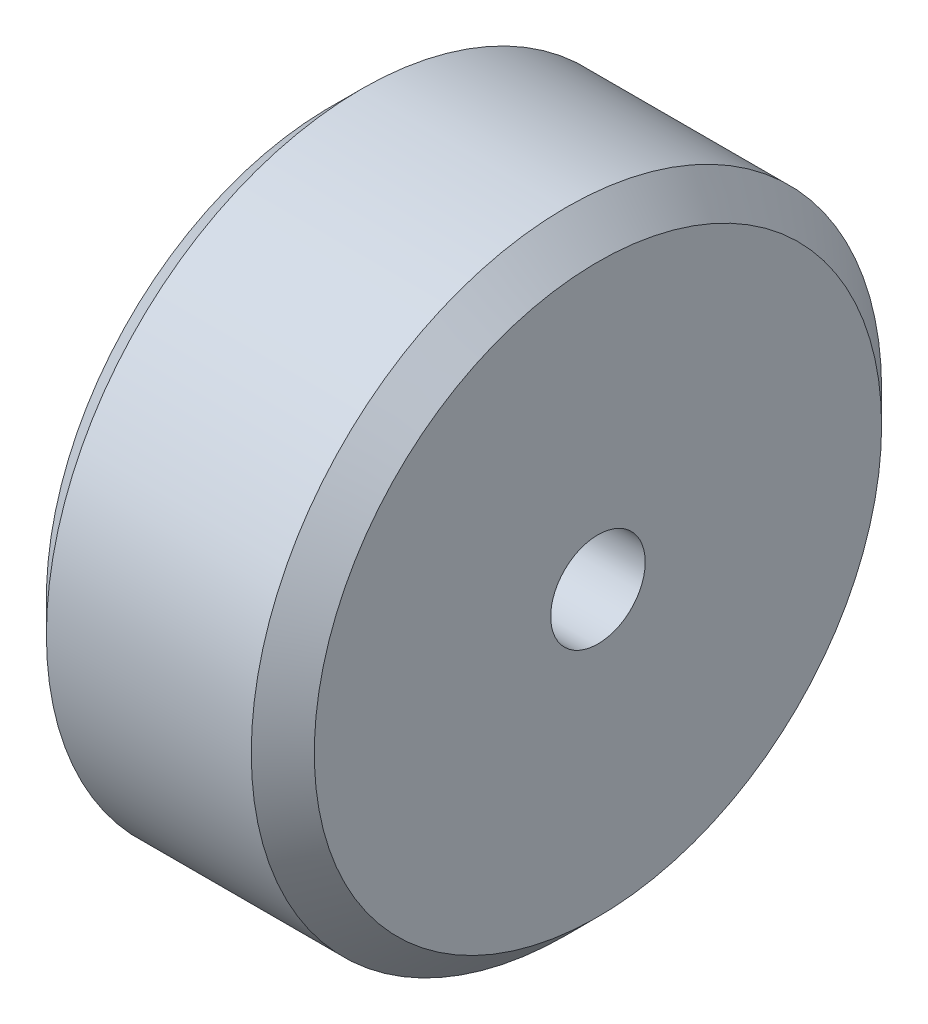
ISO-10303-21;
HEADER;
FILE_DESCRIPTION(('STEP AP214'),'2;1');
FILE_NAME('part.step','',(''),(''),'','','');
FILE_SCHEMA(('AUTOMOTIVE_DESIGN { 1 0 10303 214 1 1 1 1 }'));
ENDSEC;
DATA;
#1=APPLICATION_CONTEXT('core data for automotive mechanical design processes');
#2=APPLICATION_PROTOCOL_DEFINITION('international standard','automotive_design',2000,#1);
#3=PRODUCT_CONTEXT('',#1,'mechanical');
#4=PRODUCT('Part','Part','',(#3));
#5=PRODUCT_RELATED_PRODUCT_CATEGORY('part','',(#4));
#6=PRODUCT_DEFINITION_FORMATION('','',#4);
#7=PRODUCT_DEFINITION_CONTEXT('part definition',#1,'design');
#8=PRODUCT_DEFINITION('design','',#6,#7);
#9=PRODUCT_DEFINITION_SHAPE('','',#8);
#10=(LENGTH_UNIT() NAMED_UNIT(*) SI_UNIT(.MILLI.,.METRE.));
#11=(NAMED_UNIT(*) PLANE_ANGLE_UNIT() SI_UNIT($,.RADIAN.));
#12=(NAMED_UNIT(*) SI_UNIT($,.STERADIAN.) SOLID_ANGLE_UNIT());
#13=UNCERTAINTY_MEASURE_WITH_UNIT(LENGTH_MEASURE(1.E-05),#10,'distance_accuracy_value','');
#14=(GEOMETRIC_REPRESENTATION_CONTEXT(3) GLOBAL_UNCERTAINTY_ASSIGNED_CONTEXT((#13)) GLOBAL_UNIT_ASSIGNED_CONTEXT((#10,
#11,#12)) REPRESENTATION_CONTEXT('',''));
#15=CARTESIAN_POINT('',(0.,0.,0.));
#16=DIRECTION('',(0.,0.,1.));
#17=DIRECTION('',(1.,0.,0.));
#18=AXIS2_PLACEMENT_3D('',#15,#16,#17);
#19=CARTESIAN_POINT('',(10.795,0.,0.));
#20=DIRECTION('',(-1.,0.,0.));
#21=DIRECTION('',(0.,0.,1.));
#22=AXIS2_PLACEMENT_3D('',#19,#20,#21);
#23=CYLINDRICAL_SURFACE('',#22,12.7);
#24=CARTESIAN_POINT('',(1.27,0.,0.));
#25=DIRECTION('',(1.,0.,0.));
#26=DIRECTION('',(0.,0.,-1.));
#27=AXIS2_PLACEMENT_3D('',#24,#25,#26);
#28=CIRCLE('',#27,12.7);
#29=CARTESIAN_POINT('',(1.27,0.,-12.7));
#30=VERTEX_POINT('',#29);
#31=EDGE_CURVE('E41',#30,#30,#28,.T.);
#32=ORIENTED_EDGE('',*,*,#31,.T.);
#33=EDGE_LOOP('',(#32));
#34=FACE_BOUND('',#33,.T.);
#35=CARTESIAN_POINT('',(9.52499999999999,0.,0.));
#36=DIRECTION('',(1.,0.,0.));
#37=DIRECTION('',(0.,0.,-1.));
#38=AXIS2_PLACEMENT_3D('',#35,#36,#37);
#39=CIRCLE('',#38,12.7);
#40=CARTESIAN_POINT('',(9.52499999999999,0.,-12.7));
#41=VERTEX_POINT('',#40);
#42=EDGE_CURVE('E45',#41,#41,#39,.F.);
#43=ORIENTED_EDGE('',*,*,#42,.T.);
#44=EDGE_LOOP('',(#43));
#45=FACE_BOUND('',#44,.T.);
#46=ADVANCED_FACE('F30',(#34,#45),#23,.T.);
#47=CARTESIAN_POINT('',(10.795,0.,0.));
#48=DIRECTION('',(1.,0.,0.));
#49=DIRECTION('',(0.,0.,-1.));
#50=AXIS2_PLACEMENT_3D('',#47,#48,#49);
#51=PLANE('',#50);
#52=CARTESIAN_POINT('',(10.795,0.,0.));
#53=DIRECTION('',(1.,0.,0.));
#54=DIRECTION('',(0.,0.,-1.));
#55=AXIS2_PLACEMENT_3D('',#52,#53,#54);
#56=CIRCLE('',#55,11.43);
#57=CARTESIAN_POINT('',(10.795,0.,-11.43));
#58=VERTEX_POINT('',#57);
#59=EDGE_CURVE('E10',#58,#58,#56,.T.);
#60=ORIENTED_EDGE('',*,*,#59,.T.);
#61=EDGE_LOOP('',(#60));
#62=FACE_BOUND('',#61,.T.);
#63=CARTESIAN_POINT('',(10.795,0.,0.));
#64=DIRECTION('',(1.,0.,0.));
#65=DIRECTION('',(0.,0.,-1.));
#66=AXIS2_PLACEMENT_3D('',#63,#64,#65);
#67=CIRCLE('',#66,1.905);
#68=CARTESIAN_POINT('',(10.795,0.,-1.905));
#69=VERTEX_POINT('',#68);
#70=EDGE_CURVE('E51',#69,#69,#67,.T.);
#71=ORIENTED_EDGE('',*,*,#70,.F.);
#72=EDGE_LOOP('',(#71));
#73=FACE_BOUND('',#72,.T.);
#74=ADVANCED_FACE('F66',(#62,#73),#51,.T.);
#75=CARTESIAN_POINT('',(0.,0.,0.));
#76=DIRECTION('',(1.,0.,0.));
#77=DIRECTION('',(0.,0.,-1.));
#78=AXIS2_PLACEMENT_3D('',#75,#76,#77);
#79=PLANE('',#78);
#80=CARTESIAN_POINT('',(0.,0.,0.));
#81=DIRECTION('',(1.,0.,0.));
#82=DIRECTION('',(0.,0.,-1.));
#83=AXIS2_PLACEMENT_3D('',#80,#81,#82);
#84=CIRCLE('',#83,11.43);
#85=CARTESIAN_POINT('',(0.,0.,-11.43));
#86=VERTEX_POINT('',#85);
#87=EDGE_CURVE('E37',#86,#86,#84,.F.);
#88=ORIENTED_EDGE('',*,*,#87,.T.);
#89=EDGE_LOOP('',(#88));
#90=FACE_BOUND('',#89,.T.);
#91=CARTESIAN_POINT('',(0.,0.,0.));
#92=DIRECTION('',(1.,0.,0.));
#93=DIRECTION('',(0.,0.,-1.));
#94=AXIS2_PLACEMENT_3D('',#91,#92,#93);
#95=CIRCLE('',#94,1.905);
#96=CARTESIAN_POINT('',(0.,0.,-1.905));
#97=VERTEX_POINT('',#96);
#98=EDGE_CURVE('E50',#97,#97,#95,.T.);
#99=ORIENTED_EDGE('',*,*,#98,.T.);
#100=EDGE_LOOP('',(#99));
#101=FACE_BOUND('',#100,.T.);
#102=ADVANCED_FACE('F57',(#90,#101),#79,.F.);
#103=CARTESIAN_POINT('',(0.,0.,0.));
#104=DIRECTION('',(1.,0.,0.));
#105=DIRECTION('',(0.,0.,-1.));
#106=AXIS2_PLACEMENT_3D('',#103,#104,#105);
#107=CYLINDRICAL_SURFACE('',#106,1.905);
#108=ORIENTED_EDGE('',*,*,#98,.F.);
#109=EDGE_LOOP('',(#108));
#110=FACE_BOUND('',#109,.T.);
#111=ORIENTED_EDGE('',*,*,#70,.T.);
#112=EDGE_LOOP('',(#111));
#113=FACE_BOUND('',#112,.T.);
#114=ADVANCED_FACE('F59',(#110,#113),#107,.F.);
#115=CARTESIAN_POINT('',(1.27,0.,0.));
#116=DIRECTION('',(1.,0.,0.));
#117=DIRECTION('',(0.,0.,-1.));
#118=AXIS2_PLACEMENT_3D('',#115,#116,#117);
#119=CONICAL_SURFACE('',#118,12.7,0.78539816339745);
#120=ORIENTED_EDGE('',*,*,#87,.F.);
#121=EDGE_LOOP('',(#120));
#122=FACE_BOUND('',#121,.T.);
#123=ORIENTED_EDGE('',*,*,#31,.F.);
#124=EDGE_LOOP('',(#123));
#125=FACE_BOUND('',#124,.T.);
#126=ADVANCED_FACE('F62',(#122,#125),#119,.T.);
#127=CARTESIAN_POINT('',(10.795,0.,0.));
#128=DIRECTION('',(-1.,0.,0.));
#129=DIRECTION('',(0.,0.,1.));
#130=AXIS2_PLACEMENT_3D('',#127,#128,#129);
#131=CONICAL_SURFACE('',#130,11.43,0.785398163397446);
#132=ORIENTED_EDGE('',*,*,#42,.F.);
#133=EDGE_LOOP('',(#132));
#134=FACE_BOUND('',#133,.T.);
#135=ORIENTED_EDGE('',*,*,#59,.F.);
#136=EDGE_LOOP('',(#135));
#137=FACE_BOUND('',#136,.T.);
#138=ADVANCED_FACE('F32',(#134,#137),#131,.T.);
#139=CLOSED_SHELL('',(#46,#74,#102,#114,#126,#138));
#140=MANIFOLD_SOLID_BREP('B2',#139);
#141=ADVANCED_BREP_SHAPE_REPRESENTATION('',(#18,#140),#14);
#142=SHAPE_DEFINITION_REPRESENTATION(#9,#141);
ENDSEC;
END-ISO-10303-21;
